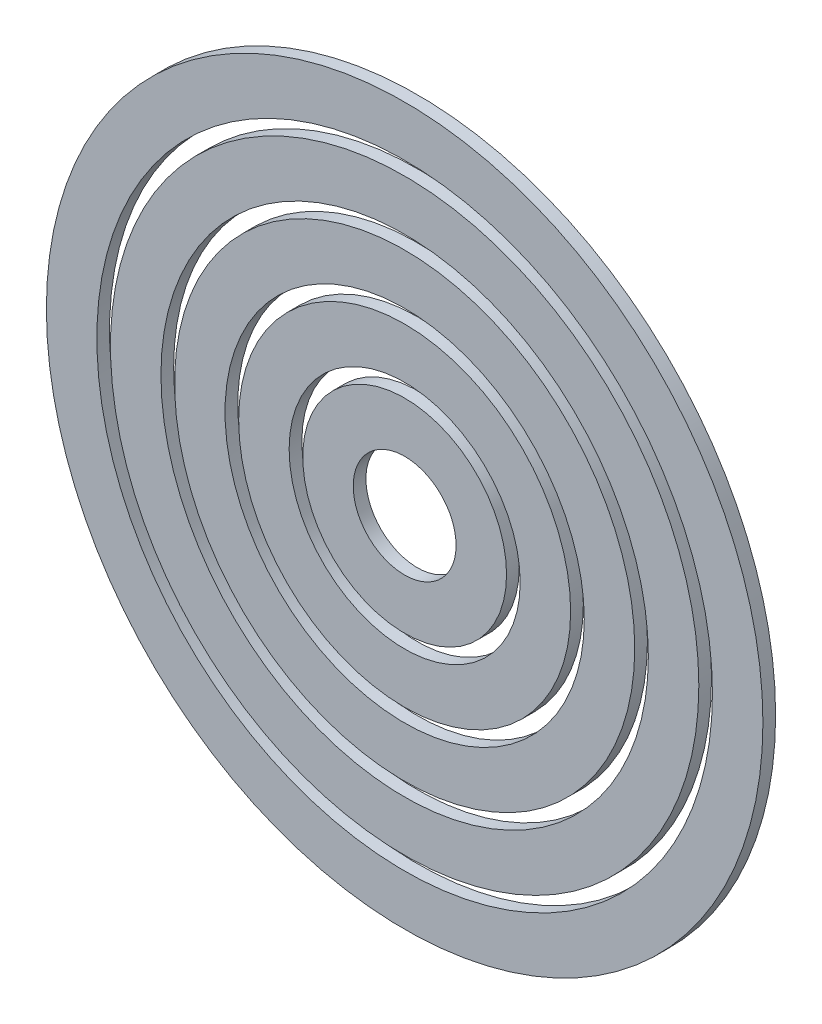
from build123d import *

# Parameters (mm, degrees)
SKETCH1_R             = 55.9
SKETCH1_R_2           = 48.026
BOSS_EXTRUDE1_DEPTH   = 1.9812
SKETCH1_R_3           = 45.9
SKETCH1_R_4           = 38.026
BOSS_EXTRUDE1_2_DEPTH = 1.9812
SKETCH1_R_5           = 35.9
SKETCH1_R_6           = 28.026
BOSS_EXTRUDE1_3_DEPTH = 1.9812
SKETCH1_R_7           = 25.9
SKETCH1_R_8           = 18.026
BOSS_EXTRUDE1_4_DEPTH = 1.9812
SKETCH1_R_9           = 15.9
SKETCH1_R_10          = 8.026
BOSS_EXTRUDE1_5_DEPTH = 1.9812


with BuildPart() as part:
    # Sketch1 → Boss-Extrude1 (new body)
    with BuildSketch(Plane.XY):
        Circle(SKETCH1_R)
        Circle(SKETCH1_R_2, mode=Mode.SUBTRACT)
    extrude(amount=BOSS_EXTRUDE1_DEPTH)


with BuildPart() as body_2:
    # Sketch1 → Boss-Extrude1 2 (new body)
    with BuildSketch(Plane.XY):
        Circle(SKETCH1_R_3)
        Circle(SKETCH1_R_4, mode=Mode.SUBTRACT)
    extrude(amount=BOSS_EXTRUDE1_2_DEPTH)


with BuildPart() as body_3:
    # Sketch1 → Boss-Extrude1 3 (new body)
    with BuildSketch(Plane.XY):
        Circle(SKETCH1_R_5)
        Circle(SKETCH1_R_6, mode=Mode.SUBTRACT)
    extrude(amount=BOSS_EXTRUDE1_3_DEPTH)


with BuildPart() as body_4:
    # Sketch1 → Boss-Extrude1 4 (new body)
    with BuildSketch(Plane.XY):
        Circle(SKETCH1_R_7)
        Circle(SKETCH1_R_8, mode=Mode.SUBTRACT)
    extrude(amount=BOSS_EXTRUDE1_4_DEPTH)


with BuildPart() as body_5:
    # Sketch1 → Boss-Extrude1 5 (new body)
    with BuildSketch(Plane.XY):
        Circle(SKETCH1_R_9)
        Circle(SKETCH1_R_10, mode=Mode.SUBTRACT)
    extrude(amount=BOSS_EXTRUDE1_5_DEPTH)


solid = Compound([part.part, body_2.part, body_3.part, body_4.part, body_5.part])
